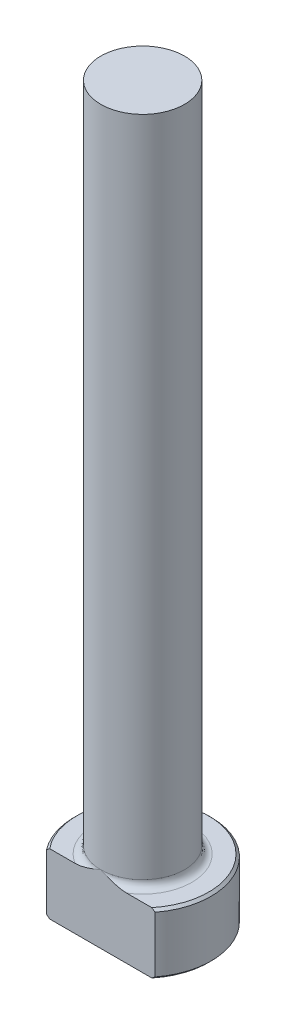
ISO-10303-21;
HEADER;
FILE_DESCRIPTION(('STEP AP214'),'2;1');
FILE_NAME('part.step','',(''),(''),'','','');
FILE_SCHEMA(('AUTOMOTIVE_DESIGN { 1 0 10303 214 1 1 1 1 }'));
ENDSEC;
DATA;
#1=APPLICATION_CONTEXT('core data for automotive mechanical design processes');
#2=APPLICATION_PROTOCOL_DEFINITION('international standard','automotive_design',2000,#1);
#3=PRODUCT_CONTEXT('',#1,'mechanical');
#4=PRODUCT('Part','Part','',(#3));
#5=PRODUCT_RELATED_PRODUCT_CATEGORY('part','',(#4));
#6=PRODUCT_DEFINITION_FORMATION('','',#4);
#7=PRODUCT_DEFINITION_CONTEXT('part definition',#1,'design');
#8=PRODUCT_DEFINITION('design','',#6,#7);
#9=PRODUCT_DEFINITION_SHAPE('','',#8);
#10=(LENGTH_UNIT() NAMED_UNIT(*) SI_UNIT(.MILLI.,.METRE.));
#11=(NAMED_UNIT(*) PLANE_ANGLE_UNIT() SI_UNIT($,.RADIAN.));
#12=(NAMED_UNIT(*) SI_UNIT($,.STERADIAN.) SOLID_ANGLE_UNIT());
#13=UNCERTAINTY_MEASURE_WITH_UNIT(LENGTH_MEASURE(1.E-05),#10,'distance_accuracy_value','');
#14=(GEOMETRIC_REPRESENTATION_CONTEXT(3) GLOBAL_UNCERTAINTY_ASSIGNED_CONTEXT((#13)) GLOBAL_UNIT_ASSIGNED_CONTEXT((#10,
#11,#12)) REPRESENTATION_CONTEXT('',''));
#15=CARTESIAN_POINT('',(0.,0.,0.));
#16=DIRECTION('',(0.,0.,1.));
#17=DIRECTION('',(1.,0.,0.));
#18=AXIS2_PLACEMENT_3D('',#15,#16,#17);
#19=CARTESIAN_POINT('',(0.,0.,0.));
#20=DIRECTION('',(0.,-1.,0.));
#21=DIRECTION('',(0.,0.,-1.));
#22=AXIS2_PLACEMENT_3D('',#19,#20,#21);
#23=PLANE('',#22);
#24=CARTESIAN_POINT('',(0.,0.,0.));
#25=DIRECTION('',(0.,-1.,0.));
#26=DIRECTION('',(0.,0.,-1.));
#27=AXIS2_PLACEMENT_3D('',#24,#25,#26);
#28=CIRCLE('',#27,6.8834);
#29=CARTESIAN_POINT('',(-5.32241090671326,0.,4.36498999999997));
#30=VERTEX_POINT('',#29);
#31=CARTESIAN_POINT('',(5.32241090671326,0.,4.36498999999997));
#32=VERTEX_POINT('',#31);
#33=EDGE_CURVE('E98',#30,#32,#28,.T.);
#34=ORIENTED_EDGE('',*,*,#33,.T.);
#35=DIRECTION('',(-1.,0.,0.));
#36=VECTOR('',#35,1.);
#37=CARTESIAN_POINT('',(-5.64706481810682,0.,4.36498999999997));
#38=LINE('',#37,#36);
#39=EDGE_CURVE('E83',#32,#30,#38,.T.);
#40=ORIENTED_EDGE('',*,*,#39,.T.);
#41=EDGE_LOOP('',(#34,#40));
#42=FACE_BOUND('',#41,.T.);
#43=ADVANCED_FACE('F32',(#42),#23,.T.);
#44=CARTESIAN_POINT('',(0.,259.958771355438,0.));
#45=DIRECTION('',(0.,1.,0.));
#46=DIRECTION('',(0.,0.,1.));
#47=AXIS2_PLACEMENT_3D('',#44,#45,#46);
#48=CYLINDRICAL_SURFACE('',#47,7.13739999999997);
#49=CARTESIAN_POINT('',(0.,6.09600000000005,0.));
#50=DIRECTION('',(0.,1.,0.));
#51=DIRECTION('',(0.,0.,1.));
#52=AXIS2_PLACEMENT_3D('',#49,#50,#51);
#53=CIRCLE('',#52,7.13739999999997);
#54=CARTESIAN_POINT('',(-5.64706481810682,6.09600000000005,4.36498999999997));
#55=VERTEX_POINT('',#54);
#56=CARTESIAN_POINT('',(5.64706481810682,6.09600000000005,4.36498999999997));
#57=VERTEX_POINT('',#56);
#58=EDGE_CURVE('E104',#55,#57,#53,.F.);
#59=ORIENTED_EDGE('',*,*,#58,.T.);
#60=DIRECTION('',(0.,-1.,0.));
#61=VECTOR('',#60,1.);
#62=CARTESIAN_POINT('',(5.64706481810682,76.2,4.36498999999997));
#63=LINE('',#62,#61);
#64=CARTESIAN_POINT('',(5.64706481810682,0.253999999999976,4.36498999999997));
#65=VERTEX_POINT('',#64);
#66=EDGE_CURVE('E183',#57,#65,#63,.T.);
#67=ORIENTED_EDGE('',*,*,#66,.T.);
#68=CARTESIAN_POINT('',(0.,0.253999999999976,0.));
#69=DIRECTION('',(0.,-1.,0.));
#70=DIRECTION('',(0.,0.,-1.));
#71=AXIS2_PLACEMENT_3D('',#68,#69,#70);
#72=CIRCLE('',#71,7.13739999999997);
#73=CARTESIAN_POINT('',(-5.64706481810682,0.253999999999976,4.36498999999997));
#74=VERTEX_POINT('',#73);
#75=EDGE_CURVE('E100',#65,#74,#72,.F.);
#76=ORIENTED_EDGE('',*,*,#75,.T.);
#77=DIRECTION('',(0.,-1.,0.));
#78=VECTOR('',#77,1.);
#79=CARTESIAN_POINT('',(-5.64706481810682,76.2,4.36498999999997));
#80=LINE('',#79,#78);
#81=EDGE_CURVE('E93',#55,#74,#80,.T.);
#82=ORIENTED_EDGE('',*,*,#81,.F.);
#83=EDGE_LOOP('',(#59,#67,#76,#82));
#84=FACE_BOUND('',#83,.T.);
#85=ADVANCED_FACE('F158',(#84),#48,.T.);
#86=CARTESIAN_POINT('',(-7.13739999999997,6.35,0.));
#87=DIRECTION('',(0.,1.,0.));
#88=DIRECTION('',(0.,0.,1.));
#89=AXIS2_PLACEMENT_3D('',#86,#87,#88);
#90=PLANE('',#89);
#91=CARTESIAN_POINT('',(0.,6.35,0.));
#92=DIRECTION('',(0.,1.,0.));
#93=DIRECTION('',(0.,0.,1.));
#94=AXIS2_PLACEMENT_3D('',#91,#92,#93);
#95=CIRCLE('',#94,6.88340000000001);
#96=CARTESIAN_POINT('',(5.32241090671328,6.35,4.36498999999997));
#97=VERTEX_POINT('',#96);
#98=CARTESIAN_POINT('',(-5.32241090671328,6.35,4.36498999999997));
#99=VERTEX_POINT('',#98);
#100=EDGE_CURVE('E178',#97,#99,#95,.T.);
#101=ORIENTED_EDGE('',*,*,#100,.T.);
#102=DIRECTION('',(1.,0.,0.));
#103=VECTOR('',#102,1.);
#104=CARTESIAN_POINT('',(-7.13739999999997,6.35,4.36498999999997));
#105=LINE('',#104,#103);
#106=CARTESIAN_POINT('',(-2.68940304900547,6.35000000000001,4.36498999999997));
#107=VERTEX_POINT('',#106);
#108=EDGE_CURVE('E57',#99,#107,#105,.T.);
#109=ORIENTED_EDGE('',*,*,#108,.T.);
#110=CARTESIAN_POINT('',(0.,6.35,0.));
#111=DIRECTION('',(0.,1.,0.));
#112=DIRECTION('',(0.,0.,1.));
#113=AXIS2_PLACEMENT_3D('',#110,#111,#112);
#114=CIRCLE('',#113,5.12698999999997);
#115=CARTESIAN_POINT('',(2.68940304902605,6.35000000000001,4.36498999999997));
#116=VERTEX_POINT('',#115);
#117=EDGE_CURVE('E107',#107,#116,#114,.F.);
#118=ORIENTED_EDGE('',*,*,#117,.T.);
#119=EDGE_CURVE('E136',#116,#97,#105,.T.);
#120=ORIENTED_EDGE('',*,*,#119,.T.);
#121=EDGE_LOOP('',(#101,#109,#118,#120));
#122=FACE_BOUND('',#121,.T.);
#123=ADVANCED_FACE('F147',(#122),#90,.T.);
#124=CARTESIAN_POINT('',(0.,6.35000000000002,0.));
#125=DIRECTION('',(0.,-1.,0.));
#126=DIRECTION('',(0.,0.,-1.));
#127=AXIS2_PLACEMENT_3D('',#124,#125,#126);
#128=CONICAL_SURFACE('',#127,6.88339999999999,0.785398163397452);
#129=ORIENTED_EDGE('',*,*,#58,.F.);
#130=CARTESIAN_POINT('',(-12.4254560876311,0.0635443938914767,4.36498999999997));
#131=CARTESIAN_POINT('',(-12.2264754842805,0.251274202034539,4.36498999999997));
#132=CARTESIAN_POINT('',(-12.027251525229,0.438746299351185,4.36498999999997));
#133=CARTESIAN_POINT('',(-11.6282346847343,0.813086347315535,4.36498999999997));
#134=CARTESIAN_POINT('',(-11.4284417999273,0.999954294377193,4.36498999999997));
#135=CARTESIAN_POINT('',(-10.8277329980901,1.55984821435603,4.36498999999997));
#136=CARTESIAN_POINT('',(-10.4258415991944,1.9318290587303,4.36498999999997));
#137=CARTESIAN_POINT('',(-9.60540983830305,2.68403168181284,4.36498999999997));
#138=CARTESIAN_POINT('',(-9.18675348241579,3.06412737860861,4.36498999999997));
#139=CARTESIAN_POINT('',(-8.55495234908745,3.62966956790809,4.36498999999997));
#140=CARTESIAN_POINT('',(-8.34380112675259,3.81734255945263,4.36498999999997));
#141=CARTESIAN_POINT('',(-7.91988421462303,4.19085479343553,4.36498999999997));
#142=CARTESIAN_POINT('',(-7.70711853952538,4.37669405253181,4.36498999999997));
#143=CARTESIAN_POINT('',(-7.27981523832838,4.74592147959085,4.36498999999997));
#144=CARTESIAN_POINT('',(-7.0652794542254,4.92931177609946,4.36498999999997));
#145=CARTESIAN_POINT('',(-6.63376365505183,5.29321745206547,4.36498999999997));
#146=CARTESIAN_POINT('',(-6.41678354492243,5.47373271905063,4.36498999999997));
#147=CARTESIAN_POINT('',(-5.97919715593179,5.83150772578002,4.36498999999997));
#148=CARTESIAN_POINT('',(-5.75858285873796,6.00875768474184,4.36498999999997));
#149=CARTESIAN_POINT('',(-5.31347514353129,6.35828986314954,4.36498999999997));
#150=CARTESIAN_POINT('',(-5.08898216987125,6.53057264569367,4.36498999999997));
#151=CARTESIAN_POINT('',(-4.63823656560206,6.86598134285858,4.36498999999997));
#152=CARTESIAN_POINT('',(-4.4120557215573,7.02920333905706,4.36498999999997));
#153=CARTESIAN_POINT('',(-3.95321518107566,7.34667825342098,4.36498999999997));
#154=CARTESIAN_POINT('',(-3.7205520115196,7.50092622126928,4.36498999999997));
#155=CARTESIAN_POINT('',(-3.36592178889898,7.72212517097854,4.36498999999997));
#156=CARTESIAN_POINT('',(-3.24703751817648,7.79401703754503,4.36498999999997));
#157=CARTESIAN_POINT('',(-3.00696415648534,7.93383106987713,4.36498999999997));
#158=CARTESIAN_POINT('',(-2.88577534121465,8.00175370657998,4.36498999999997));
#159=CARTESIAN_POINT('',(-2.64094314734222,8.13271025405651,4.36498999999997));
#160=CARTESIAN_POINT('',(-2.51730263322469,8.19574949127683,4.36498999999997));
#161=CARTESIAN_POINT('',(-2.2672111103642,8.31594515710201,4.36498999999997));
#162=CARTESIAN_POINT('',(-2.14076077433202,8.37310297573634,4.36498999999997));
#163=CARTESIAN_POINT('',(-1.88226589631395,8.48134616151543,4.36498999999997));
#164=CARTESIAN_POINT('',(-1.75015999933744,8.53228640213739,4.36498999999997));
#165=CARTESIAN_POINT('',(-1.48274649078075,8.62515083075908,4.36498999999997));
#166=CARTESIAN_POINT('',(-1.34743816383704,8.66707298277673,4.36498999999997));
#167=CARTESIAN_POINT('',(-1.07468401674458,8.73996841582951,4.36498999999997));
#168=CARTESIAN_POINT('',(-0.937254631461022,8.77100233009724,4.36498999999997));
#169=CARTESIAN_POINT('',(-0.660180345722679,8.82086954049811,4.36498999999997));
#170=CARTESIAN_POINT('',(-0.520535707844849,8.83970427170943,4.36498999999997));
#171=CARTESIAN_POINT('',(-0.238572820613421,8.86417414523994,4.36498999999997));
#172=CARTESIAN_POINT('',(-0.0962419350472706,8.86966662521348,4.36498999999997));
#173=CARTESIAN_POINT('',(0.188262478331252,8.86666840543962,4.36498999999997));
#174=CARTESIAN_POINT('',(0.330436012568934,8.85817829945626,4.36498999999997));
#175=CARTESIAN_POINT('',(0.613882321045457,8.82771699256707,4.36498999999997));
#176=CARTESIAN_POINT('',(0.755149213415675,8.80569197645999,4.36498999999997));
#177=CARTESIAN_POINT('',(1.03521985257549,8.74943185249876,4.36498999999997));
#178=CARTESIAN_POINT('',(1.17402294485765,8.71519354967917,4.36498999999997));
#179=CARTESIAN_POINT('',(1.51066758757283,8.61833915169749,4.36498999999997));
#180=CARTESIAN_POINT('',(1.70682320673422,8.54989183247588,4.36498999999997));
#181=CARTESIAN_POINT('',(2.09235587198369,8.3960724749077,4.36498999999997));
#182=CARTESIAN_POINT('',(2.28172826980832,8.31068908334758,4.36498999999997));
#183=CARTESIAN_POINT('',(2.56204757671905,8.1727135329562,4.36498999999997));
#184=CARTESIAN_POINT('',(2.65534447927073,8.12479314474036,4.36498999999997));
#185=CARTESIAN_POINT('',(2.84046183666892,8.02617252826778,4.36498999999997));
#186=CARTESIAN_POINT('',(2.9322822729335,7.97547226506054,4.36498999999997));
#187=CARTESIAN_POINT('',(3.11452054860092,7.87170555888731,4.36498999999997));
#188=CARTESIAN_POINT('',(3.20493895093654,7.81864010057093,4.36498999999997));
#189=CARTESIAN_POINT('',(3.38452391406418,7.71044662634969,4.36498999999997));
#190=CARTESIAN_POINT('',(3.47369053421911,7.65531870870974,4.36498999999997));
#191=CARTESIAN_POINT('',(3.77921712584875,7.46215440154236,4.36498999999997));
#192=CARTESIAN_POINT('',(3.99276944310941,7.31966964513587,4.36498999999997));
#193=CARTESIAN_POINT('',(4.414590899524,7.02705367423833,4.36498999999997));
#194=CARTESIAN_POINT('',(4.62285858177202,6.87692038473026,4.36498999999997));
#195=CARTESIAN_POINT('',(5.03538827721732,6.57088260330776,4.36498999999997));
#196=CARTESIAN_POINT('',(5.23964647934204,6.41497299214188,4.36498999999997));
#197=CARTESIAN_POINT('',(5.64480634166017,6.09891103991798,4.36498999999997));
#198=CARTESIAN_POINT('',(5.84570833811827,5.93875912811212,4.36498999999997));
#199=CARTESIAN_POINT('',(6.24560426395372,5.61454392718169,4.36498999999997));
#200=CARTESIAN_POINT('',(6.44458790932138,5.45046798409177,4.36498999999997));
#201=CARTESIAN_POINT('',(6.84037485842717,5.11970386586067,4.36498999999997));
#202=CARTESIAN_POINT('',(7.03717811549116,4.95301563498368,4.36498999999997));
#203=CARTESIAN_POINT('',(7.4288932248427,4.61763773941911,4.36498999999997));
#204=CARTESIAN_POINT('',(7.62380600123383,4.44894915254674,4.36498999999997));
#205=CARTESIAN_POINT('',(8.01214949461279,4.10987343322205,4.36498999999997));
#206=CARTESIAN_POINT('',(8.20558019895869,3.93948628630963,4.36498999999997));
#207=CARTESIAN_POINT('',(8.74077078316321,3.46461406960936,4.36498999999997));
#208=CARTESIAN_POINT('',(9.08120180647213,3.15863169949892,4.36498999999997));
#209=CARTESIAN_POINT('',(9.75921761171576,2.54343968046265,4.36498999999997));
#210=CARTESIAN_POINT('',(10.0968019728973,2.23422956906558,4.36498999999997));
#211=CARTESIAN_POINT('',(10.7672168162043,1.6157662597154,4.36498999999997));
#212=CARTESIAN_POINT('',(11.1000639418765,1.30653108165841,4.36498999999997));
#213=CARTESIAN_POINT('',(11.7639719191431,0.68626870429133,4.36498999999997));
#214=CARTESIAN_POINT('',(12.0950330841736,0.375241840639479,4.36498999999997));
#215=CARTESIAN_POINT('',(12.4254560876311,0.0635443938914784,4.36498999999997));
#216=B_SPLINE_CURVE_WITH_KNOTS('',3,(#130,#131,#132,#133,#134,#135,#136,#137,#138,#139,#140,
#141,#142,#143,#144,#145,#146,#147,#148,#149,#150,#151,#152,#153,#154,#155,#156,#157,#158,#159,
#160,#161,#162,#163,#164,#165,#166,#167,#168,#169,#170,#171,#172,#173,#174,#175,#176,#177,#178,
#179,#180,#181,#182,#183,#184,#185,#186,#187,#188,#189,#190,#191,#192,#193,#194,#195,#196,#197,
#198,#199,#200,#201,#202,#203,#204,#205,#206,#207,#208,#209,#210,#211,#212,#213,#214,#215),
.UNSPECIFIED.,.F.,.F.,(4,2,2,2,2,2,2,2,2,2,2,2,2,2,2,2,2,2,2,2,2,2,2,2,2,2,2,2,2,2,2,2,2,2,2,2,
2,2,2,2,2,2,4),(0.,0.820683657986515,1.64137217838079,3.28421321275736,4.98055028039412,
5.82804083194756,6.67552367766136,7.52221443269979,8.36893822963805,9.21788289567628,
10.0667309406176,10.9033662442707,11.7404587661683,12.1571934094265,12.5738785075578,
12.9901025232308,13.4062279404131,13.8307163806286,14.2553005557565,14.6774813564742,
15.0996124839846,15.5262377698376,15.952844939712,16.3811593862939,16.8095859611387,
17.4317469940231,18.0543265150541,18.3689414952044,18.6835604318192,18.9980495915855,
19.3125237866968,20.0824228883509,20.8525319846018,21.6233407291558,22.3940717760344,
23.1677612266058,23.9414672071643,24.714773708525,25.4880867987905,26.8612512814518,
28.2346152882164,29.5975903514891,30.9603178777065),.UNSPECIFIED.);
#217=EDGE_CURVE('E135',#55,#99,#216,.T.);
#218=ORIENTED_EDGE('',*,*,#217,.T.);
#219=ORIENTED_EDGE('',*,*,#100,.F.);
#220=EDGE_CURVE('E127',#97,#57,#216,.T.);
#221=ORIENTED_EDGE('',*,*,#220,.T.);
#222=EDGE_LOOP('',(#129,#218,#219,#221));
#223=FACE_BOUND('',#222,.T.);
#224=ADVANCED_FACE('F143',(#223),#128,.T.);
#225=CARTESIAN_POINT('',(0.,0.253999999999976,0.));
#226=DIRECTION('',(0.,1.,0.));
#227=DIRECTION('',(0.,0.,1.));
#228=AXIS2_PLACEMENT_3D('',#225,#226,#227);
#229=CONICAL_SURFACE('',#228,7.13739999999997,0.785398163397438);
#230=ORIENTED_EDGE('',*,*,#75,.F.);
#231=CARTESIAN_POINT('',(12.4254560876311,6.28645560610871,4.36498999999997));
#232=CARTESIAN_POINT('',(12.2264754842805,6.09872579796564,4.36498999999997));
#233=CARTESIAN_POINT('',(12.027251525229,5.91125370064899,4.36498999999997));
#234=CARTESIAN_POINT('',(11.6282346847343,5.53691365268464,4.36498999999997));
#235=CARTESIAN_POINT('',(11.4284417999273,5.35004570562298,4.36498999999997));
#236=CARTESIAN_POINT('',(10.8277329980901,4.79015178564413,4.36498999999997));
#237=CARTESIAN_POINT('',(10.4258415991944,4.41817094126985,4.36498999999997));
#238=CARTESIAN_POINT('',(9.60540983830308,3.6659683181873,4.36498999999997));
#239=CARTESIAN_POINT('',(9.18675348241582,3.28587262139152,4.36498999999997));
#240=CARTESIAN_POINT('',(8.55495234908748,2.72033043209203,4.36498999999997));
#241=CARTESIAN_POINT('',(8.34380112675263,2.53265744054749,4.36498999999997));
#242=CARTESIAN_POINT('',(7.91988421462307,2.15914520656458,4.36498999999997));
#243=CARTESIAN_POINT('',(7.70711853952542,1.9733059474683,4.36498999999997));
#244=CARTESIAN_POINT('',(7.27981523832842,1.60407852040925,4.36498999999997));
#245=CARTESIAN_POINT('',(7.06527945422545,1.42068822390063,4.36498999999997));
#246=CARTESIAN_POINT('',(6.63376365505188,1.05678254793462,4.36498999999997));
#247=CARTESIAN_POINT('',(6.41678354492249,0.876267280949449,4.36498999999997));
#248=CARTESIAN_POINT('',(5.97919715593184,0.518492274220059,4.36498999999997));
#249=CARTESIAN_POINT('',(5.75858285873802,0.341242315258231,4.36498999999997));
#250=CARTESIAN_POINT('',(5.31347514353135,-0.0082898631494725,4.36498999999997));
#251=CARTESIAN_POINT('',(5.08898216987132,-0.180572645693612,4.36498999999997));
#252=CARTESIAN_POINT('',(4.63823656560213,-0.515981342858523,4.36498999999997));
#253=CARTESIAN_POINT('',(4.41205572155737,-0.67920333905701,4.36498999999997));
#254=CARTESIAN_POINT('',(3.95321518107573,-0.996678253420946,4.36498999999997));
#255=CARTESIAN_POINT('',(3.72055201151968,-1.15092622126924,4.36498999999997));
#256=CARTESIAN_POINT('',(3.36592178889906,-1.37212517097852,4.36498999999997));
#257=CARTESIAN_POINT('',(3.24703751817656,-1.444017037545,4.36498999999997));
#258=CARTESIAN_POINT('',(3.00696415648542,-1.58383106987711,4.36498999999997));
#259=CARTESIAN_POINT('',(2.88577534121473,-1.65175370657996,4.36498999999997));
#260=CARTESIAN_POINT('',(2.6409431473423,-1.7827102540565,4.36498999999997));
#261=CARTESIAN_POINT('',(2.51730263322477,-1.84574949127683,4.36498999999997));
#262=CARTESIAN_POINT('',(2.26721111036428,-1.965945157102,4.36498999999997));
#263=CARTESIAN_POINT('',(2.1407607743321,-2.02310297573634,4.36498999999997));
#264=CARTESIAN_POINT('',(1.88226589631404,-2.13134616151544,4.36498999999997));
#265=CARTESIAN_POINT('',(1.75015999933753,-2.1822864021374,4.36498999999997));
#266=CARTESIAN_POINT('',(1.48274649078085,-2.2751508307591,4.36498999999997));
#267=CARTESIAN_POINT('',(1.34743816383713,-2.31707298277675,4.36498999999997));
#268=CARTESIAN_POINT('',(1.07468401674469,-2.38996841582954,4.36498999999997));
#269=CARTESIAN_POINT('',(0.937254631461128,-2.42100233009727,4.36498999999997));
#270=CARTESIAN_POINT('',(0.660180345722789,-2.47086954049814,4.36498999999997));
#271=CARTESIAN_POINT('',(0.520535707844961,-2.48970427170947,4.36498999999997));
#272=CARTESIAN_POINT('',(0.238572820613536,-2.51417414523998,4.36498999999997));
#273=CARTESIAN_POINT('',(0.0962419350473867,-2.51966662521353,4.36498999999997));
#274=CARTESIAN_POINT('',(-0.188262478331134,-2.51666840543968,4.36498999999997));
#275=CARTESIAN_POINT('',(-0.330436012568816,-2.50817829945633,4.36498999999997));
#276=CARTESIAN_POINT('',(-0.613882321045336,-2.47771699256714,4.36498999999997));
#277=CARTESIAN_POINT('',(-0.755149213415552,-2.45569197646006,4.36498999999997));
#278=CARTESIAN_POINT('',(-1.03521985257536,-2.39943185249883,4.36498999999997));
#279=CARTESIAN_POINT('',(-1.17402294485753,-2.36519354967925,4.36498999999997));
#280=CARTESIAN_POINT('',(-1.51066758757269,-2.26833915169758,4.36498999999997));
#281=CARTESIAN_POINT('',(-1.70682320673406,-2.19989183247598,4.36498999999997));
#282=CARTESIAN_POINT('',(-2.09235587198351,-2.04607247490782,4.36498999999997));
#283=CARTESIAN_POINT('',(-2.28172826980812,-1.96068908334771,4.36498999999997));
#284=CARTESIAN_POINT('',(-2.56204757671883,-1.82271353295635,4.36498999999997));
#285=CARTESIAN_POINT('',(-2.65534447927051,-1.77479314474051,4.36498999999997));
#286=CARTESIAN_POINT('',(-2.84046183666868,-1.67617252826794,4.36498999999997));
#287=CARTESIAN_POINT('',(-2.93228227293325,-1.62547226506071,4.36498999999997));
#288=CARTESIAN_POINT('',(-3.11452054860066,-1.52170555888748,4.36498999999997));
#289=CARTESIAN_POINT('',(-3.20493895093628,-1.46864010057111,4.36498999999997));
#290=CARTESIAN_POINT('',(-3.38452391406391,-1.36044662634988,4.36498999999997));
#291=CARTESIAN_POINT('',(-3.47369053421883,-1.30531870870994,4.36498999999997));
#292=CARTESIAN_POINT('',(-3.77921712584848,-1.11215440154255,4.36498999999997));
#293=CARTESIAN_POINT('',(-3.99276944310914,-0.969669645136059,4.36498999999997));
#294=CARTESIAN_POINT('',(-4.41459089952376,-0.677053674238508,4.36498999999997));
#295=CARTESIAN_POINT('',(-4.62285858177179,-0.526920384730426,4.36498999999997));
#296=CARTESIAN_POINT('',(-5.03538827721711,-0.220882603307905,4.36498999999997));
#297=CARTESIAN_POINT('',(-5.23964647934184,-0.0649729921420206,4.36498999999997));
#298=CARTESIAN_POINT('',(-5.64480634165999,0.2510889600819,4.36498999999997));
#299=CARTESIAN_POINT('',(-5.8457083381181,0.411240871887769,4.36498999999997));
#300=CARTESIAN_POINT('',(-6.24560426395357,0.735456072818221,4.36498999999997));
#301=CARTESIAN_POINT('',(-6.44458790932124,0.899532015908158,4.36498999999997));
#302=CARTESIAN_POINT('',(-6.84037485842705,1.23029613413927,4.36498999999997));
#303=CARTESIAN_POINT('',(-7.03717811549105,1.39698436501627,4.36498999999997));
#304=CARTESIAN_POINT('',(-7.42889322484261,1.73236226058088,4.36498999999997));
#305=CARTESIAN_POINT('',(-7.62380600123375,1.90105084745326,4.36498999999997));
#306=CARTESIAN_POINT('',(-8.01214949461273,2.24012656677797,4.36498999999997));
#307=CARTESIAN_POINT('',(-8.20558019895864,2.4105137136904,4.36498999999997));
#308=CARTESIAN_POINT('',(-8.74077078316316,2.88538593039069,4.36498999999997));
#309=CARTESIAN_POINT('',(-9.08120180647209,3.19136830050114,4.36498999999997));
#310=CARTESIAN_POINT('',(-9.75921761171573,3.80656031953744,4.36498999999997));
#311=CARTESIAN_POINT('',(-10.0968019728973,4.11577043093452,4.36498999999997));
#312=CARTESIAN_POINT('',(-10.7672168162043,4.73423374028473,4.36498999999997));
#313=CARTESIAN_POINT('',(-11.1000639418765,5.04346891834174,4.36498999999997));
#314=CARTESIAN_POINT('',(-11.7639719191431,5.66373129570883,4.36498999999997));
#315=CARTESIAN_POINT('',(-12.0950330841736,5.9747581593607,4.36498999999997));
#316=CARTESIAN_POINT('',(-12.4254560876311,6.28645560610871,4.36498999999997));
#317=B_SPLINE_CURVE_WITH_KNOTS('',3,(#231,#232,#233,#234,#235,#236,#237,#238,#239,#240,#241,
#242,#243,#244,#245,#246,#247,#248,#249,#250,#251,#252,#253,#254,#255,#256,#257,#258,#259,#260,
#261,#262,#263,#264,#265,#266,#267,#268,#269,#270,#271,#272,#273,#274,#275,#276,#277,#278,#279,
#280,#281,#282,#283,#284,#285,#286,#287,#288,#289,#290,#291,#292,#293,#294,#295,#296,#297,#298,
#299,#300,#301,#302,#303,#304,#305,#306,#307,#308,#309,#310,#311,#312,#313,#314,#315,#316),
.UNSPECIFIED.,.F.,.F.,(4,2,2,2,2,2,2,2,2,2,2,2,2,2,2,2,2,2,2,2,2,2,2,2,2,2,2,2,2,2,2,2,2,2,2,2,
2,2,2,2,2,2,4),(0.,0.820683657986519,1.64137217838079,3.28421321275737,4.98055028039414,
5.82804083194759,6.67552367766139,7.52221443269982,8.36893822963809,9.21788289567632,
10.0667309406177,10.9033662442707,11.7404587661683,12.1571934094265,12.5738785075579,
12.9901025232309,13.4062279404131,13.8307163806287,14.2553005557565,14.6774813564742,
15.0996124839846,15.5262377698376,15.952844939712,16.3811593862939,16.8095859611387,
17.4317469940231,18.054326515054,18.3689414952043,18.683560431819,18.9980495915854,
19.3125237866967,20.0824228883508,20.8525319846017,21.6233407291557,22.3940717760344,
23.1677612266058,23.9414672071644,24.7147737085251,25.4880867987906,26.861251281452,
28.2346152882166,29.5975903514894,30.9603178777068),.UNSPECIFIED.);
#318=EDGE_CURVE('E86',#65,#32,#317,.T.);
#319=ORIENTED_EDGE('',*,*,#318,.T.);
#320=ORIENTED_EDGE('',*,*,#33,.F.);
#321=EDGE_CURVE('E89',#30,#74,#317,.T.);
#322=ORIENTED_EDGE('',*,*,#321,.T.);
#323=EDGE_LOOP('',(#230,#319,#320,#322));
#324=FACE_BOUND('',#323,.T.);
#325=ADVANCED_FACE('F97',(#324),#229,.T.);
#326=CARTESIAN_POINT('',(0.,7.11200000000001,0.));
#327=DIRECTION('',(0.,1.,0.));
#328=DIRECTION('',(0.,0.,1.));
#329=AXIS2_PLACEMENT_3D('',#326,#327,#328);
#330=TOROIDAL_SURFACE('',#329,5.12698999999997,0.762);
#331=CARTESIAN_POINT('',(0.,7.11200000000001,4.36498999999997));
#332=CARTESIAN_POINT('',(1.978186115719E-11,7.11200099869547,4.36498999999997));
#333=CARTESIAN_POINT('',(1.99998569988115E-07,7.11200199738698,4.36498999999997));
#334=CARTESIAN_POINT('',(8.39708111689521E-07,7.11200392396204,4.36498999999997));
#335=CARTESIAN_POINT('',(1.28513797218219E-06,7.11200484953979,4.36498999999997));
#336=CARTESIAN_POINT('',(2.35714654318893E-06,7.11200669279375,4.36498999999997));
#337=CARTESIAN_POINT('',(2.99576916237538E-06,7.11200760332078,4.36498999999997));
#338=CARTESIAN_POINT('',(4.37706148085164E-06,7.1120093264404,4.36498999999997));
#339=CARTESIAN_POINT('',(5.11891983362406E-06,7.11201013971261,4.36498999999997));
#340=CARTESIAN_POINT('',(7.76598241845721E-06,7.11201284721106,4.36498999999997));
#341=CARTESIAN_POINT('',(9.80707323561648E-06,7.11201461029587,4.36498999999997));
#342=CARTESIAN_POINT('',(1.40385710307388E-05,7.11201776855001,4.36498999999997));
#343=CARTESIAN_POINT('',(1.62217218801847E-05,7.1120191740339,4.36498999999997));
#344=CARTESIAN_POINT('',(2.46880925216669E-05,7.11202440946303,4.36498999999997));
#345=CARTESIAN_POINT('',(3.11510761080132E-05,7.11202796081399,4.36498999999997));
#346=CARTESIAN_POINT('',(4.39385738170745E-05,7.11203381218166,4.36498999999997));
#347=CARTESIAN_POINT('',(5.02270954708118E-05,7.11203619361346,4.36498999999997));
#348=CARTESIAN_POINT('',(7.68671397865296E-05,7.11204623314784,4.36498999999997));
#349=CARTESIAN_POINT('',(9.7243194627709E-05,7.11205379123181,4.36498999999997));
#350=CARTESIAN_POINT('',(0.000135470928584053,7.11206600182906,4.36498999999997));
#351=CARTESIAN_POINT('',(0.00015323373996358,7.11207092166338,4.36498999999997));
#352=CARTESIAN_POINT('',(0.000281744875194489,7.11210968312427,4.36498999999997));
#353=CARTESIAN_POINT('',(0.000387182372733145,7.11215881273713,4.36498999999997));
#354=CARTESIAN_POINT('',(0.0007963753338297,7.11234245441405,4.36498999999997));
#355=CARTESIAN_POINT('',(0.0011038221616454,7.11246560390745,4.36498999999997));
#356=CARTESIAN_POINT('',(0.00229468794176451,7.11294975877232,4.36498999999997));
#357=CARTESIAN_POINT('',(0.00317431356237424,7.11332268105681,4.36498999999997));
#358=CARTESIAN_POINT('',(0.00676396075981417,7.11483719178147,4.36498999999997));
#359=CARTESIAN_POINT('',(0.00947818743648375,7.11596530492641,4.36498999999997));
#360=CARTESIAN_POINT('',(0.0441052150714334,7.13036680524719,4.36498999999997));
#361=CARTESIAN_POINT('',(0.0759900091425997,7.14373054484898,4.36498999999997));
#362=CARTESIAN_POINT('',(0.140245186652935,7.17056976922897,4.36498999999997));
#363=CARTESIAN_POINT('',(0.172615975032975,7.18404410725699,4.36498999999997));
#364=CARTESIAN_POINT('',(0.266939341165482,7.2232177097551,4.36498999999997));
#365=CARTESIAN_POINT('',(0.328921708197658,7.2488485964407,4.36498999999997));
#366=CARTESIAN_POINT('',(0.460259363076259,7.30262060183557,4.36498999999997));
#367=CARTESIAN_POINT('',(0.529636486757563,7.33070831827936,4.36498999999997));
#368=CARTESIAN_POINT('',(0.669424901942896,7.38634205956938,4.36498999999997));
#369=CARTESIAN_POINT('',(0.739839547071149,7.41387970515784,4.36498999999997));
#370=CARTESIAN_POINT('',(0.862842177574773,7.46081950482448,4.36498999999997));
#371=CARTESIAN_POINT('',(0.915329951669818,7.48048352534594,4.36498999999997));
#372=CARTESIAN_POINT('',(1.02046271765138,7.51898724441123,4.36498999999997));
#373=CARTESIAN_POINT('',(1.07310702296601,7.53782882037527,4.36498999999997));
#374=CARTESIAN_POINT('',(1.22921061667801,7.59217247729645,4.36498999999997));
#375=CARTESIAN_POINT('',(1.33312863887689,7.6263793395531,4.36498999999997));
#376=CARTESIAN_POINT('',(1.53643041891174,7.68824550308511,4.36498999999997));
#377=CARTESIAN_POINT('',(1.63573333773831,7.71616747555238,4.36498999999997));
#378=CARTESIAN_POINT('',(1.83640023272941,7.76677412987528,4.36498999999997));
#379=CARTESIAN_POINT('',(1.93777359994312,7.78942216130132,4.36498999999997));
#380=CARTESIAN_POINT('',(2.14806985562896,7.8289052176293,4.36498999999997));
#381=CARTESIAN_POINT('',(2.25707764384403,7.84530422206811,4.36498999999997));
#382=CARTESIAN_POINT('',(2.47588714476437,7.8679551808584,4.36498999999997));
#383=CARTESIAN_POINT('',(2.58568573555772,7.8742357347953,4.36498999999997));
#384=CARTESIAN_POINT('',(2.80336826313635,7.87375511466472,4.36498999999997));
#385=CARTESIAN_POINT('',(2.91124890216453,7.8672396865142,4.36498999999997));
#386=CARTESIAN_POINT('',(3.07062418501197,7.84522848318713,4.36498999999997));
#387=CARTESIAN_POINT('',(3.12298608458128,7.83595753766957,4.36498999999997));
#388=CARTESIAN_POINT('',(3.22666070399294,7.81280437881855,4.36498999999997));
#389=CARTESIAN_POINT('',(3.27797430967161,7.79892624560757,4.36498999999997));
#390=CARTESIAN_POINT('',(3.38017940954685,7.76544111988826,4.36498999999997));
#391=CARTESIAN_POINT('',(3.43102695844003,7.7456973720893,4.36498999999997));
#392=CARTESIAN_POINT('',(3.52988459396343,7.69970911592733,4.36498999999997));
#393=CARTESIAN_POINT('',(3.57788972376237,7.67345364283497,4.36498999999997));
#394=CARTESIAN_POINT('',(3.66130804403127,7.61871950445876,4.36498999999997));
#395=CARTESIAN_POINT('',(3.69746927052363,7.59139302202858,4.36498999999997));
#396=CARTESIAN_POINT('',(3.76496315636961,7.53131589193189,4.36498999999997));
#397=CARTESIAN_POINT('',(3.79630619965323,7.49857723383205,4.36498999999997));
#398=CARTESIAN_POINT('',(3.84495128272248,7.43683881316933,4.36498999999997));
#399=CARTESIAN_POINT('',(3.86378946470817,7.40905436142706,4.36498999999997));
#400=CARTESIAN_POINT('',(3.89672638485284,7.35078028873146,4.36498999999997));
#401=CARTESIAN_POINT('',(3.91082770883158,7.32029215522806,4.36498999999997));
#402=CARTESIAN_POINT('',(3.93341223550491,7.25699125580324,4.36498999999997));
#403=CARTESIAN_POINT('',(3.94184931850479,7.22416175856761,4.36498999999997));
#404=CARTESIAN_POINT('',(3.95218231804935,7.15748848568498,4.36498999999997));
#405=CARTESIAN_POINT('',(3.95408288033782,7.12364544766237,4.36498999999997));
#406=CARTESIAN_POINT('',(3.95136441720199,7.06046973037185,4.36498999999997));
#407=CARTESIAN_POINT('',(3.9475277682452,7.0311001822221,4.36498999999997));
#408=CARTESIAN_POINT('',(3.93500297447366,6.97342339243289,4.36498999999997));
#409=CARTESIAN_POINT('',(3.92631446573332,6.94511623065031,4.36498999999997));
#410=CARTESIAN_POINT('',(3.90455033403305,6.89001086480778,4.36498999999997));
#411=CARTESIAN_POINT('',(3.89144136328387,6.86322599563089,4.36498999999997));
#412=CARTESIAN_POINT('',(3.86154779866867,6.81181251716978,4.36498999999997));
#413=CARTESIAN_POINT('',(3.84476178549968,6.78718474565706,4.36498999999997));
#414=CARTESIAN_POINT('',(3.79878996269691,6.7282136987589,4.36498999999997));
#415=CARTESIAN_POINT('',(3.76766438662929,6.69537977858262,4.36498999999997));
#416=CARTESIAN_POINT('',(3.70055719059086,6.63508686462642,4.36498999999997));
#417=CARTESIAN_POINT('',(3.66456200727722,6.6076434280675,4.36498999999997));
#418=CARTESIAN_POINT('',(3.57073436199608,6.54553586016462,4.36498999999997));
#419=CARTESIAN_POINT('',(3.51086920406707,6.51395945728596,4.36498999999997));
#420=CARTESIAN_POINT('',(3.38720496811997,6.46043181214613,4.36498999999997));
#421=CARTESIAN_POINT('',(3.32340792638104,6.43847563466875,4.36498999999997));
#422=CARTESIAN_POINT('',(3.20476663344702,6.40562206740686,4.36498999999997));
#423=CARTESIAN_POINT('',(3.1502567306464,6.39347570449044,4.36498999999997));
#424=CARTESIAN_POINT('',(3.04037476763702,6.37391844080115,4.36498999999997));
#425=CARTESIAN_POINT('',(2.9850020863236,6.36651112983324,4.36498999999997));
#426=CARTESIAN_POINT('',(2.81676792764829,6.35028316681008,4.36498999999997));
#427=CARTESIAN_POINT('',(2.70328636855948,6.3478280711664,4.36498999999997));
#428=CARTESIAN_POINT('',(2.47743093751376,6.35562327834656,4.36498999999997));
#429=CARTESIAN_POINT('',(2.36505442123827,6.36582075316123,4.36498999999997));
#430=CARTESIAN_POINT('',(2.14134717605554,6.39595595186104,4.36498999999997));
#431=CARTESIAN_POINT('',(2.03002022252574,6.41592067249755,4.36498999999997));
#432=CARTESIAN_POINT('',(1.81574268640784,6.46192564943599,4.36498999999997));
#433=CARTESIAN_POINT('',(1.71269400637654,6.48752328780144,4.36498999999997));
#434=CARTESIAN_POINT('',(1.5087524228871,6.54368522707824,4.36498999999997));
#435=CARTESIAN_POINT('',(1.40784949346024,6.57421361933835,4.36498999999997));
#436=CARTESIAN_POINT('',(1.21296099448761,6.63733902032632,4.36498999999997));
#437=CARTESIAN_POINT('',(1.11890560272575,6.66972305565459,4.36498999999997));
#438=CARTESIAN_POINT('',(0.977477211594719,6.72063405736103,4.36498999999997));
#439=CARTESIAN_POINT('',(0.929753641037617,6.73819873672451,4.36498999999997));
#440=CARTESIAN_POINT('',(0.834408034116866,6.77394896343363,4.36498999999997));
#441=CARTESIAN_POINT('',(0.786786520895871,6.79213590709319,4.36498999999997));
#442=CARTESIAN_POINT('',(0.675011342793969,6.83546784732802,4.36498999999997));
#443=CARTESIAN_POINT('',(0.610934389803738,6.86081017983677,4.36498999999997));
#444=CARTESIAN_POINT('',(0.483679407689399,6.91188188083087,4.36498999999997));
#445=CARTESIAN_POINT('',(0.42049880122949,6.93760483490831,4.36498999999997));
#446=CARTESIAN_POINT('',(0.300843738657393,6.98673638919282,4.36498999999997));
#447=CARTESIAN_POINT('',(0.244353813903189,7.01010811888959,4.36498999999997));
#448=CARTESIAN_POINT('',(0.129321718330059,7.05800562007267,4.36498999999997));
#449=CARTESIAN_POINT('',(0.0707833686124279,7.08254143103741,4.36498999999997));
#450=CARTESIAN_POINT('',(0.00947845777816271,7.10803440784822,4.36498999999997));
#451=CARTESIAN_POINT('',(0.00676459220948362,7.1091625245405,4.36498999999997));
#452=CARTESIAN_POINT('',(0.00317503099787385,7.11067702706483,4.36498999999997));
#453=CARTESIAN_POINT('',(0.00229516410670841,7.11105004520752,4.36498999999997));
#454=CARTESIAN_POINT('',(0.00110399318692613,7.11153432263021,4.36498999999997));
#455=CARTESIAN_POINT('',(0.000796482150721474,7.11165749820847,4.36498999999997));
#456=CARTESIAN_POINT('',(0.000387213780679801,7.11184117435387,4.36498999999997));
#457=CARTESIAN_POINT('',(0.000281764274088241,7.11189030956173,4.36498999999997));
#458=CARTESIAN_POINT('',(0.000153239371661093,7.11192907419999,4.36498999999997));
#459=CARTESIAN_POINT('',(0.00013547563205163,7.11193399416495,4.36498999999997));
#460=CARTESIAN_POINT('',(9.72458689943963E-05,7.11194620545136,4.36498999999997));
#461=CARTESIAN_POINT('',(7.68687384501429E-05,7.1119537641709,4.36498999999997));
#462=CARTESIAN_POINT('',(5.02274868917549E-05,7.11196380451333,4.36498999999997));
#463=CARTESIAN_POINT('',(4.39388185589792E-05,7.11196618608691,4.36498999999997));
#464=CARTESIAN_POINT('',(3.11510467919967E-05,7.1119720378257,4.36498999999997));
#465=CARTESIAN_POINT('',(2.46879409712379E-05,7.11197558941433,4.36498999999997));
#466=CARTESIAN_POINT('',(1.62214567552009E-05,7.11198082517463,4.36498999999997));
#467=CARTESIAN_POINT('',(1.40382945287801E-05,7.11198223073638,4.36498999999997));
#468=CARTESIAN_POINT('',(9.80678955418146E-06,7.11198538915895,4.36498999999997));
#469=CARTESIAN_POINT('',(7.76570365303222E-06,7.11198715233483,4.36498999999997));
#470=CARTESIAN_POINT('',(5.11866647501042E-06,7.11198985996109,4.36498999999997));
#471=CARTESIAN_POINT('',(4.37681913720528E-06,7.11199067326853,4.36498999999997));
#472=CARTESIAN_POINT('',(2.99555513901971E-06,7.11199239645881,4.36498999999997));
#473=CARTESIAN_POINT('',(2.35694988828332E-06,7.11199330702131,4.36498999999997));
#474=CARTESIAN_POINT('',(1.28498332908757E-06,7.11199515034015,4.36498999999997));
#475=CARTESIAN_POINT('',(8.39577314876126E-07,7.11199607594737,4.36498999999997));
#476=CARTESIAN_POINT('',(1.99925497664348E-07,7.11199800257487,4.36498999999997));
#477=CARTESIAN_POINT('',(-1.97821606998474E-11,7.11199900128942,4.36498999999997));
#478=CARTESIAN_POINT('',(0.,7.11200000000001,4.36498999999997));
#479=B_SPLINE_CURVE_WITH_KNOTS('',3,(#331,#332,#333,#334,#335,#336,#337,#338,#339,#340,#341,
#342,#343,#344,#345,#346,#347,#348,#349,#350,#351,#352,#353,#354,#355,#356,#357,#358,#359,#360,
#361,#362,#363,#364,#365,#366,#367,#368,#369,#370,#371,#372,#373,#374,#375,#376,#377,#378,#379,
#380,#381,#382,#383,#384,#385,#386,#387,#388,#389,#390,#391,#392,#393,#394,#395,#396,#397,#398,
#399,#400,#401,#402,#403,#404,#405,#406,#407,#408,#409,#410,#411,#412,#413,#414,#415,#416,#417,
#418,#419,#420,#421,#422,#423,#424,#425,#426,#427,#428,#429,#430,#431,#432,#433,#434,#435,#436,
#437,#438,#439,#440,#441,#442,#443,#444,#445,#446,#447,#448,#449,#450,#451,#452,#453,#454,#455,
#456,#457,#458,#459,#460,#461,#462,#463,#464,#465,#466,#467,#468,#469,#470,#471,#472,#473,#474,
#475,#476,#477,#478),.UNSPECIFIED.,.T.,.F.,(4,2,2,2,2,2,2,2,2,2,2,2,2,2,2,2,2,2,2,2,2,2,2,2,2,2,
2,2,2,2,2,2,2,2,2,2,2,2,2,2,2,2,2,2,2,2,2,2,2,2,2,2,2,2,2,2,2,2,2,2,2,2,2,2,2,2,2,2,2,2,2,2,2,
4),(0.,2.99393356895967E-06,6.06050544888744E-06,9.38381538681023E-06,1.26823447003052E-05,
2.07341902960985E-05,2.85173295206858E-05,5.05679958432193E-05,7.07200265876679E-05,
0.000135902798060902,0.000191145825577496,0.000538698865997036,0.00153343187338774,
0.00439823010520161,0.0132177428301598,0.116922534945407,0.222114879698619,0.423330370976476,
0.647869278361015,0.874684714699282,1.04283007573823,1.21056905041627,1.53868958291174,
1.84803288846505,2.15946572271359,2.48979250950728,2.81918398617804,3.14231135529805,
3.30167514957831,3.46089818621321,3.62417169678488,3.78772202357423,3.92324280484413,
4.05846729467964,4.15879636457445,4.25907057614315,4.36015165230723,4.46116087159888,
4.54959198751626,4.6380297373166,4.7271501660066,4.81630505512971,4.95126592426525,
5.08661075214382,5.28852636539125,5.49033827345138,5.65764369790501,5.82507570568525,
6.16451317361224,6.50253815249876,6.84150275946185,7.15988132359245,7.47603795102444,
7.77440962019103,7.92696651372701,8.07989164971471,8.28660620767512,8.49125135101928,
8.67465770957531,8.86505269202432,8.87387116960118,8.87673674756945,8.87773168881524,
8.87807928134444,8.87813452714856,8.87819971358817,8.87821986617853,8.87824191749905,
8.87824970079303,8.87825775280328,8.87826105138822,8.87826437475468,8.87826744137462,
8.87827043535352),.UNSPECIFIED.);
#480=CARTESIAN_POINT('',(0.,7.11200000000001,4.36498999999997));
#481=VERTEX_POINT('',#480);
#482=EDGE_CURVE('E11',#116,#481,#479,.T.);
#483=ORIENTED_EDGE('',*,*,#482,.F.);
#484=ORIENTED_EDGE('',*,*,#117,.F.);
#485=CARTESIAN_POINT('',(0.,7.11200000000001,4.36498999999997));
#486=CARTESIAN_POINT('',(-1.97818554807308E-11,7.11199900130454,4.36498999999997));
#487=CARTESIAN_POINT('',(-1.99998569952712E-07,7.11199800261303,4.36498999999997));
#488=CARTESIAN_POINT('',(-8.39708111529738E-07,7.11199607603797,4.36498999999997));
#489=CARTESIAN_POINT('',(-1.28513797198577E-06,7.11199515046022,4.36498999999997));
#490=CARTESIAN_POINT('',(-2.3571465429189E-06,7.11199330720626,4.36498999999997));
#491=CARTESIAN_POINT('',(-2.99576916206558E-06,7.11199239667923,4.36498999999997));
#492=CARTESIAN_POINT('',(-4.37706148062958E-06,7.11199067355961,4.36498999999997));
#493=CARTESIAN_POINT('',(-5.11891983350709E-06,7.1119898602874,4.36498999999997));
#494=CARTESIAN_POINT('',(-7.76598241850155E-06,7.11198715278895,4.36498999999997));
#495=CARTESIAN_POINT('',(-9.80707323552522E-06,7.11198538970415,4.36498999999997));
#496=CARTESIAN_POINT('',(-1.4038571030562E-05,7.11198223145,4.36498999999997));
#497=CARTESIAN_POINT('',(-1.62217218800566E-05,7.11198082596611,4.36498999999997));
#498=CARTESIAN_POINT('',(-2.46880925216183E-05,7.11197559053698,4.36498999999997));
#499=CARTESIAN_POINT('',(-3.11510761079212E-05,7.11197203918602,4.36498999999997));
#500=CARTESIAN_POINT('',(-4.39385738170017E-05,7.11196618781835,4.36498999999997));
#501=CARTESIAN_POINT('',(-5.02270954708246E-05,7.11196380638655,4.36498999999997));
#502=CARTESIAN_POINT('',(-7.68671397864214E-05,7.11195376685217,4.36498999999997));
#503=CARTESIAN_POINT('',(-9.72431946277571E-05,7.1119462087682,4.36498999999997));
#504=CARTESIAN_POINT('',(-0.000135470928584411,7.11193399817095,4.36498999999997));
#505=CARTESIAN_POINT('',(-0.000153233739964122,7.11192907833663,4.36498999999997));
#506=CARTESIAN_POINT('',(-0.000281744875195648,7.11189031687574,4.36498999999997));
#507=CARTESIAN_POINT('',(-0.00038718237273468,7.11184118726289,4.36498999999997));
#508=CARTESIAN_POINT('',(-0.000796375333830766,7.11165754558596,4.36498999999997));
#509=CARTESIAN_POINT('',(-0.00110382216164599,7.11153439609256,4.36498999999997));
#510=CARTESIAN_POINT('',(-0.00229468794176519,7.1110502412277,4.36498999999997));
#511=CARTESIAN_POINT('',(-0.00317431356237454,7.11067731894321,4.36498999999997));
#512=CARTESIAN_POINT('',(-0.00676396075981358,7.10916280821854,4.36498999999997));
#513=CARTESIAN_POINT('',(-0.00947818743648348,7.1080346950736,4.36498999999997));
#514=CARTESIAN_POINT('',(-0.0441052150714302,7.09363319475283,4.36498999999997));
#515=CARTESIAN_POINT('',(-0.0759900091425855,7.08026945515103,4.36498999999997));
#516=CARTESIAN_POINT('',(-0.140245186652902,7.05343023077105,4.36498999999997));
#517=CARTESIAN_POINT('',(-0.172615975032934,7.03995589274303,4.36498999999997));
#518=CARTESIAN_POINT('',(-0.266939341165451,7.00078229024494,4.36498999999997));
#519=CARTESIAN_POINT('',(-0.328921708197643,6.97515140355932,4.36498999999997));
#520=CARTESIAN_POINT('',(-0.460259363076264,6.92137939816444,4.36498999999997));
#521=CARTESIAN_POINT('',(-0.529636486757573,6.89329168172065,4.36498999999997));
#522=CARTESIAN_POINT('',(-0.669424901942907,6.83765794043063,4.36498999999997));
#523=CARTESIAN_POINT('',(-0.739839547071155,6.81012029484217,4.36498999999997));
#524=CARTESIAN_POINT('',(-0.862842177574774,6.76318049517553,4.36498999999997));
#525=CARTESIAN_POINT('',(-0.915329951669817,6.74351647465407,4.36498999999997));
#526=CARTESIAN_POINT('',(-1.02046271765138,6.70501275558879,4.36498999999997));
#527=CARTESIAN_POINT('',(-1.07310702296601,6.68617117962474,4.36498999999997));
#528=CARTESIAN_POINT('',(-1.22921061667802,6.63182752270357,4.36498999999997));
#529=CARTESIAN_POINT('',(-1.33312863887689,6.59762066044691,4.36498999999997));
#530=CARTESIAN_POINT('',(-1.53643041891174,6.53575449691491,4.36498999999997));
#531=CARTESIAN_POINT('',(-1.63573333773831,6.50783252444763,4.36498999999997));
#532=CARTESIAN_POINT('',(-1.83640023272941,6.45722587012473,4.36498999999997));
#533=CARTESIAN_POINT('',(-1.93777359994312,6.43457783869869,4.36498999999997));
#534=CARTESIAN_POINT('',(-2.14806985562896,6.39509478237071,4.36498999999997));
#535=CARTESIAN_POINT('',(-2.25707764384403,6.37869577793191,4.36498999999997));
#536=CARTESIAN_POINT('',(-2.47588714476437,6.35604481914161,4.36498999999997));
#537=CARTESIAN_POINT('',(-2.58568573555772,6.34976426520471,4.36498999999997));
#538=CARTESIAN_POINT('',(-2.80336826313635,6.35024488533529,4.36498999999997));
#539=CARTESIAN_POINT('',(-2.91124890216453,6.35676031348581,4.36498999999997));
#540=CARTESIAN_POINT('',(-3.07062418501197,6.37877151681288,4.36498999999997));
#541=CARTESIAN_POINT('',(-3.12298608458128,6.38804246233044,4.36498999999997));
#542=CARTESIAN_POINT('',(-3.22666070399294,6.41119562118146,4.36498999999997));
#543=CARTESIAN_POINT('',(-3.27797430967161,6.42507375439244,4.36498999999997));
#544=CARTESIAN_POINT('',(-3.38017940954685,6.45855888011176,4.36498999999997));
#545=CARTESIAN_POINT('',(-3.43102695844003,6.47830262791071,4.36498999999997));
#546=CARTESIAN_POINT('',(-3.52988459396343,6.52429088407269,4.36498999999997));
#547=CARTESIAN_POINT('',(-3.57788972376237,6.55054635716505,4.36498999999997));
#548=CARTESIAN_POINT('',(-3.66130804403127,6.60528049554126,4.36498999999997));
#549=CARTESIAN_POINT('',(-3.69746927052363,6.63260697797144,4.36498999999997));
#550=CARTESIAN_POINT('',(-3.76496315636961,6.69268410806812,4.36498999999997));
#551=CARTESIAN_POINT('',(-3.79630619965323,6.72542276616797,4.36498999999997));
#552=CARTESIAN_POINT('',(-3.84495128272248,6.78716118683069,4.36498999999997));
#553=CARTESIAN_POINT('',(-3.86378946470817,6.81494563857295,4.36498999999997));
#554=CARTESIAN_POINT('',(-3.89672638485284,6.87321971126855,4.36498999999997));
#555=CARTESIAN_POINT('',(-3.91082770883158,6.90370784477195,4.36498999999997));
#556=CARTESIAN_POINT('',(-3.93341223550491,6.96700874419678,4.36498999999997));
#557=CARTESIAN_POINT('',(-3.94184931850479,6.99983824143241,4.36498999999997));
#558=CARTESIAN_POINT('',(-3.95218231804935,7.06651151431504,4.36498999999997));
#559=CARTESIAN_POINT('',(-3.95408288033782,7.10035455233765,4.36498999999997));
#560=CARTESIAN_POINT('',(-3.95136441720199,7.16353026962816,4.36498999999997));
#561=CARTESIAN_POINT('',(-3.9475277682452,7.19289981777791,4.36498999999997));
#562=CARTESIAN_POINT('',(-3.93500297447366,7.25057660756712,4.36498999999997));
#563=CARTESIAN_POINT('',(-3.92631446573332,7.27888376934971,4.36498999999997));
#564=CARTESIAN_POINT('',(-3.90455033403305,7.33398913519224,4.36498999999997));
#565=CARTESIAN_POINT('',(-3.89144136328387,7.36077400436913,4.36498999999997));
#566=CARTESIAN_POINT('',(-3.86154779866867,7.41218748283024,4.36498999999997));
#567=CARTESIAN_POINT('',(-3.84476178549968,7.43681525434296,4.36498999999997));
#568=CARTESIAN_POINT('',(-3.79878996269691,7.49578630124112,4.36498999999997));
#569=CARTESIAN_POINT('',(-3.76766438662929,7.52862022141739,4.36498999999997));
#570=CARTESIAN_POINT('',(-3.70055719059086,7.5889131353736,4.36498999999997));
#571=CARTESIAN_POINT('',(-3.66456200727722,7.61635657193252,4.36498999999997));
#572=CARTESIAN_POINT('',(-3.57073436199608,7.6784641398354,4.36498999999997));
#573=CARTESIAN_POINT('',(-3.51086920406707,7.71004054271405,4.36498999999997));
#574=CARTESIAN_POINT('',(-3.38720496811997,7.76356818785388,4.36498999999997));
#575=CARTESIAN_POINT('',(-3.32340792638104,7.78552436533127,4.36498999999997));
#576=CARTESIAN_POINT('',(-3.20476663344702,7.81837793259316,4.36498999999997));
#577=CARTESIAN_POINT('',(-3.1502567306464,7.83052429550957,4.36498999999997));
#578=CARTESIAN_POINT('',(-3.04037476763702,7.85008155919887,4.36498999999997));
#579=CARTESIAN_POINT('',(-2.9850020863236,7.85748887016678,4.36498999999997));
#580=CARTESIAN_POINT('',(-2.81676792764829,7.87371683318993,4.36498999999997));
#581=CARTESIAN_POINT('',(-2.70328636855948,7.87617192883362,4.36498999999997));
#582=CARTESIAN_POINT('',(-2.47743093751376,7.86837672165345,4.36498999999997));
#583=CARTESIAN_POINT('',(-2.36505442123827,7.85817924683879,4.36498999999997));
#584=CARTESIAN_POINT('',(-2.14134717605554,7.82804404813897,4.36498999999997));
#585=CARTESIAN_POINT('',(-2.03002022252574,7.80807932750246,4.36498999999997));
#586=CARTESIAN_POINT('',(-1.81574268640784,7.76207435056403,4.36498999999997));
#587=CARTESIAN_POINT('',(-1.71269400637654,7.73647671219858,4.36498999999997));
#588=CARTESIAN_POINT('',(-1.5087524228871,7.68031477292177,4.36498999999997));
#589=CARTESIAN_POINT('',(-1.40784949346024,7.64978638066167,4.36498999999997));
#590=CARTESIAN_POINT('',(-1.21296099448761,7.5866609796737,4.36498999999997));
#591=CARTESIAN_POINT('',(-1.11890560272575,7.55427694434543,4.36498999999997));
#592=CARTESIAN_POINT('',(-0.977477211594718,7.50336594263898,4.36498999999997));
#593=CARTESIAN_POINT('',(-0.929753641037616,7.4858012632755,4.36498999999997));
#594=CARTESIAN_POINT('',(-0.834408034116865,7.45005103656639,4.36498999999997));
#595=CARTESIAN_POINT('',(-0.78678652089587,7.43186409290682,4.36498999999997));
#596=CARTESIAN_POINT('',(-0.675011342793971,7.388532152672,4.36498999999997));
#597=CARTESIAN_POINT('',(-0.610934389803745,7.36318982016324,4.36498999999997));
#598=CARTESIAN_POINT('',(-0.483679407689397,7.31211811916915,4.36498999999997));
#599=CARTESIAN_POINT('',(-0.420498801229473,7.28639516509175,4.36498999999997));
#600=CARTESIAN_POINT('',(-0.300843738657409,7.23726361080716,4.36498999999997));
#601=CARTESIAN_POINT('',(-0.244353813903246,7.2138918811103,4.36498999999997));
#602=CARTESIAN_POINT('',(-0.129321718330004,7.16599437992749,4.36498999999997));
#603=CARTESIAN_POINT('',(-0.0707833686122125,7.14145856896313,4.36498999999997));
#604=CARTESIAN_POINT('',(-0.00947845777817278,7.11596559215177,4.36498999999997));
#605=CARTESIAN_POINT('',(-0.00676459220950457,7.11483747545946,4.36498999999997));
#606=CARTESIAN_POINT('',(-0.00317503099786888,7.1133229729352,4.36498999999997));
#607=CARTESIAN_POINT('',(-0.00229516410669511,7.11294995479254,4.36498999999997));
#608=CARTESIAN_POINT('',(-0.00110399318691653,7.11246567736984,4.36498999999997));
#609=CARTESIAN_POINT('',(-0.000796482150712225,7.11234250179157,4.36498999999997));
#610=CARTESIAN_POINT('',(-0.000387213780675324,7.11215882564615,4.36498999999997));
#611=CARTESIAN_POINT('',(-0.000281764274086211,7.11210969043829,4.36498999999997));
#612=CARTESIAN_POINT('',(-0.000153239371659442,7.11207092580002,4.36498999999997));
#613=CARTESIAN_POINT('',(-0.000135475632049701,7.11206600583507,4.36498999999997));
#614=CARTESIAN_POINT('',(-9.72458689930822E-05,7.11205379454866,4.36498999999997));
#615=CARTESIAN_POINT('',(-7.6868738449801E-05,7.11204623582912,4.36498999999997));
#616=CARTESIAN_POINT('',(-5.02274868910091E-05,7.11203619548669,4.36498999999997));
#617=CARTESIAN_POINT('',(-4.39388185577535E-05,7.11203381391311,4.36498999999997));
#618=CARTESIAN_POINT('',(-3.11510467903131E-05,7.11202796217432,4.36498999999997));
#619=CARTESIAN_POINT('',(-2.46879409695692E-05,7.11202441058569,4.36498999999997));
#620=CARTESIAN_POINT('',(-1.62214567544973E-05,7.11201917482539,4.36498999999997));
#621=CARTESIAN_POINT('',(-1.40382945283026E-05,7.11201776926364,4.36498999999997));
#622=CARTESIAN_POINT('',(-9.80678955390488E-06,7.11201461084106,4.36498999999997));
#623=CARTESIAN_POINT('',(-7.76570365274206E-06,7.11201284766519,4.36498999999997));
#624=CARTESIAN_POINT('',(-5.11866647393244E-06,7.11201014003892,4.36498999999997));
#625=CARTESIAN_POINT('',(-4.37681913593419E-06,7.11200932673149,4.36498999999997));
#626=CARTESIAN_POINT('',(-2.99555513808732E-06,7.1120076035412,4.36498999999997));
#627=CARTESIAN_POINT('',(-2.35694988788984E-06,7.11200669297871,4.36498999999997));
#628=CARTESIAN_POINT('',(-1.28498332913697E-06,7.11200484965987,4.36498999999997));
#629=CARTESIAN_POINT('',(-8.39577314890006E-07,7.11200392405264,4.36498999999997));
#630=CARTESIAN_POINT('',(-1.99925497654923E-07,7.11200199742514,4.36498999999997));
#631=CARTESIAN_POINT('',(1.97821550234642E-11,7.1120009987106,4.36498999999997));
#632=CARTESIAN_POINT('',(0.,7.11200000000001,4.36498999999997));
#633=B_SPLINE_CURVE_WITH_KNOTS('',3,(#485,#486,#487,#488,#489,#490,#491,#492,#493,#494,#495,
#496,#497,#498,#499,#500,#501,#502,#503,#504,#505,#506,#507,#508,#509,#510,#511,#512,#513,#514,
#515,#516,#517,#518,#519,#520,#521,#522,#523,#524,#525,#526,#527,#528,#529,#530,#531,#532,#533,
#534,#535,#536,#537,#538,#539,#540,#541,#542,#543,#544,#545,#546,#547,#548,#549,#550,#551,#552,
#553,#554,#555,#556,#557,#558,#559,#560,#561,#562,#563,#564,#565,#566,#567,#568,#569,#570,#571,
#572,#573,#574,#575,#576,#577,#578,#579,#580,#581,#582,#583,#584,#585,#586,#587,#588,#589,#590,
#591,#592,#593,#594,#595,#596,#597,#598,#599,#600,#601,#602,#603,#604,#605,#606,#607,#608,#609,
#610,#611,#612,#613,#614,#615,#616,#617,#618,#619,#620,#621,#622,#623,#624,#625,#626,#627,#628,
#629,#630,#631,#632),.UNSPECIFIED.,.T.,.F.,(4,2,2,2,2,2,2,2,2,2,2,2,2,2,2,2,2,2,2,2,2,2,2,2,2,2,
2,2,2,2,2,2,2,2,2,2,2,2,2,2,2,2,2,2,2,2,2,2,2,2,2,2,2,2,2,2,2,2,2,2,2,2,2,2,2,2,2,2,2,2,2,2,2,
4),(0.,2.99393356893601E-06,6.06050544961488E-06,9.38381538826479E-06,1.26823447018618E-05,
2.07341902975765E-05,2.85173295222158E-05,5.05679958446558E-05,7.07200265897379E-05,
0.000135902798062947,0.000191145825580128,0.000538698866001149,0.00153343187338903,
0.00439823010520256,0.0132177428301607,0.116922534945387,0.222114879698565,0.423330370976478,
0.647869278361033,0.874684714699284,1.04283007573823,1.21056905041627,1.53868958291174,
1.84803288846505,2.15946572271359,2.48979250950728,2.81918398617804,3.14231135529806,
3.30167514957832,3.46089818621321,3.62417169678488,3.78772202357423,3.92324280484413,
4.05846729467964,4.15879636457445,4.25907057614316,4.36015165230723,4.46116087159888,
4.54959198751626,4.63802973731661,4.7271501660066,4.81630505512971,4.95126592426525,
5.08661075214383,5.28852636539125,5.49033827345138,5.65764369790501,5.82507570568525,
6.16451317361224,6.50253815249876,6.84150275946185,7.15988132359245,7.47603795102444,
7.77440962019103,7.92696651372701,8.07989164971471,8.28660620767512,8.49125135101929,
8.67465770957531,8.86505269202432,8.87387116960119,8.87673674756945,8.87773168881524,
8.87807928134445,8.87813452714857,8.87819971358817,8.87821986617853,8.87824191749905,
8.87824970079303,8.87825775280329,8.87826105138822,8.87826437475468,8.87826744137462,
8.87827043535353),.UNSPECIFIED.);
#634=EDGE_CURVE('E46',#481,#107,#633,.T.);
#635=ORIENTED_EDGE('',*,*,#634,.F.);
#636=CARTESIAN_POINT('',(0.,7.11200000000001,0.));
#637=DIRECTION('',(0.,1.,0.));
#638=DIRECTION('',(0.,0.,1.));
#639=AXIS2_PLACEMENT_3D('',#636,#637,#638);
#640=CIRCLE('',#639,4.36498999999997);
#641=EDGE_CURVE('E103',#481,#481,#640,.T.);
#642=ORIENTED_EDGE('',*,*,#641,.F.);
#643=EDGE_LOOP('',(#483,#484,#635,#642));
#644=FACE_BOUND('',#643,.T.);
#645=ADVANCED_FACE('F34',(#644),#330,.F.);
#646=CARTESIAN_POINT('',(0.,259.958771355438,0.));
#647=DIRECTION('',(0.,1.,0.));
#648=DIRECTION('',(0.,0.,1.));
#649=AXIS2_PLACEMENT_3D('',#646,#647,#648);
#650=CYLINDRICAL_SURFACE('',#649,4.36498999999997);
#651=ORIENTED_EDGE('',*,*,#641,.T.);
#652=EDGE_LOOP('',(#651));
#653=FACE_BOUND('',#652,.T.);
#654=CARTESIAN_POINT('',(0.,76.2,0.));
#655=DIRECTION('',(0.,1.,0.));
#656=DIRECTION('',(0.,0.,1.));
#657=AXIS2_PLACEMENT_3D('',#654,#655,#656);
#658=CIRCLE('',#657,4.36498999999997);
#659=CARTESIAN_POINT('',(0.,76.2,4.36498999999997));
#660=VERTEX_POINT('',#659);
#661=EDGE_CURVE('E101',#660,#660,#658,.T.);
#662=ORIENTED_EDGE('',*,*,#661,.F.);
#663=EDGE_LOOP('',(#662));
#664=FACE_BOUND('',#663,.T.);
#665=ADVANCED_FACE('F155',(#653,#664),#650,.T.);
#666=CARTESIAN_POINT('',(-4.36498999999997,76.2,0.));
#667=DIRECTION('',(0.,1.,0.));
#668=DIRECTION('',(0.,0.,1.));
#669=AXIS2_PLACEMENT_3D('',#666,#667,#668);
#670=PLANE('',#669);
#671=ORIENTED_EDGE('',*,*,#661,.T.);
#672=EDGE_LOOP('',(#671));
#673=FACE_BOUND('',#672,.T.);
#674=ADVANCED_FACE('F121',(#673),#670,.T.);
#675=CARTESIAN_POINT('',(-5.64706481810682,76.2,4.36498999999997));
#676=DIRECTION('',(0.,0.,1.));
#677=DIRECTION('',(1.,0.,0.));
#678=AXIS2_PLACEMENT_3D('',#675,#676,#677);
#679=PLANE('',#678);
#680=ORIENTED_EDGE('',*,*,#66,.F.);
#681=ORIENTED_EDGE('',*,*,#220,.F.);
#682=ORIENTED_EDGE('',*,*,#119,.F.);
#683=ORIENTED_EDGE('',*,*,#482,.T.);
#684=ORIENTED_EDGE('',*,*,#634,.T.);
#685=ORIENTED_EDGE('',*,*,#108,.F.);
#686=ORIENTED_EDGE('',*,*,#217,.F.);
#687=ORIENTED_EDGE('',*,*,#81,.T.);
#688=ORIENTED_EDGE('',*,*,#321,.F.);
#689=ORIENTED_EDGE('',*,*,#39,.F.);
#690=ORIENTED_EDGE('',*,*,#318,.F.);
#691=EDGE_LOOP('',(#680,#681,#682,#683,#684,#685,#686,#687,#688,#689,#690));
#692=FACE_BOUND('',#691,.T.);
#693=ADVANCED_FACE('F85',(#692),#679,.T.);
#694=CLOSED_SHELL('',(#43,#85,#123,#224,#325,#645,#665,#674,#693));
#695=MANIFOLD_SOLID_BREP('B2',#694);
#696=ADVANCED_BREP_SHAPE_REPRESENTATION('',(#18,#695),#14);
#697=SHAPE_DEFINITION_REPRESENTATION(#9,#696);
ENDSEC;
END-ISO-10303-21;
